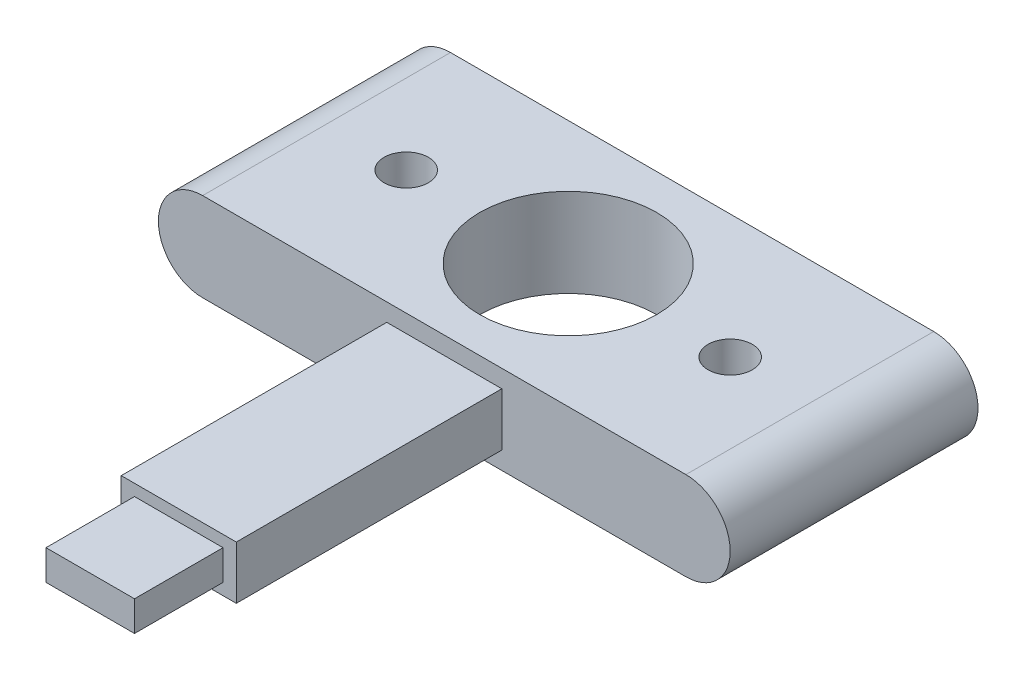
from build123d import *

# Parameters (mm, degrees)
BOSS_EXTRUDE1_DEPTH = 35.56
SKETCH2_W           = 16.51
SKETCH2_H           = 38.1
BOSS_EXTRUDE2_DEPTH = 12.7
SKETCH3_W           = 38.1
SKETCH3_H           = 2.54
CUT_EXTRUDE1_DEPTH  = 90.527703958
SKETCH4_W           = 12.7
SKETCH4_H           = 4.318
BOSS_EXTRUDE3_DEPTH = 12.7
SKETCH5_R           = 12.7
CUT_EXTRUDE2_DEPTH  = 120.79244285
SKETCH6_R           = 3.175
CUT_EXTRUDE3_DEPTH  = 5.08


with BuildPart() as part:
    # Sketch1 → Boss-Extrude1 (new body)
    with BuildSketch(Plane.XY):
        with BuildLine():
            ThreePointArc((0, 6.35), (1.859871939, 1.859871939), (6.35, 0))
            Line((6.35, 0), (75.692, 0))
            ThreePointArc((75.692, 0), (80.182128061, 1.859871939), (82.042, 6.35))
            ThreePointArc((82.042, 6.35), (80.182128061, 10.840128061), (75.692, 12.7))
            Line((75.692, 12.7), (6.35, 12.7))
            ThreePointArc((6.35, 12.7), (1.859871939, 10.840128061), (0, 6.35))
        make_face()
    extrude(amount=BOSS_EXTRUDE1_DEPTH)

    # Sketch2 → Boss-Extrude2 (add)
    with BuildSketch(Plane(origin=(0, 12.7, 0), x_dir=(1, 0, 0), z_dir=(0, 1, 0))):
        with Locations((41.021, -54.61)):
            Rectangle(SKETCH2_W, SKETCH2_H)
    extrude(amount=-BOSS_EXTRUDE2_DEPTH)

    # Sketch3 → Cut-Extrude1 (cut, through all)
    with BuildSketch(Plane.ZY.offset(-32.766)):
        with Locations((54.61, 11.43)):
            Rectangle(SKETCH3_W, SKETCH3_H)
        with Locations((54.61, 1.27)):
            Rectangle(SKETCH3_W, SKETCH3_H)
    extrude(amount=-CUT_EXTRUDE1_DEPTH, mode=Mode.SUBTRACT)

    # Sketch4 → Boss-Extrude3 (add)
    with BuildSketch(Plane.XY.offset(73.66)):
        with Locations((41.021, 6.35)):
            Rectangle(SKETCH4_W, SKETCH4_H)
    extrude(amount=BOSS_EXTRUDE3_DEPTH)

    # Sketch5 → Cut-Extrude2 (cut, through all)
    with BuildSketch(Plane(origin=(0, 12.7, 0), x_dir=(1, 0, 0), z_dir=(0, 1, 0))):
        with Locations(Location((41.021, -17.78, 0), (0, 0, 270))):
            Circle(SKETCH5_R)
    extrude(amount=-CUT_EXTRUDE2_DEPTH, mode=Mode.SUBTRACT)

    # Sketch6 → Cut-Extrude3 (cut)
    with BuildSketch(Plane(origin=(0, 12.7, 0), x_dir=(1, 0, 0), z_dir=(0, 1, 0))):
        with Locations(Location((64.262, -17.78, 0), (0, 0, 270))):
            Circle(SKETCH6_R)
        with Locations(Location((17.78, -17.78, 0), (0, 0, 90))):
            Circle(SKETCH6_R)
    extrude(amount=-CUT_EXTRUDE3_DEPTH, mode=Mode.SUBTRACT)


solid = part.part
